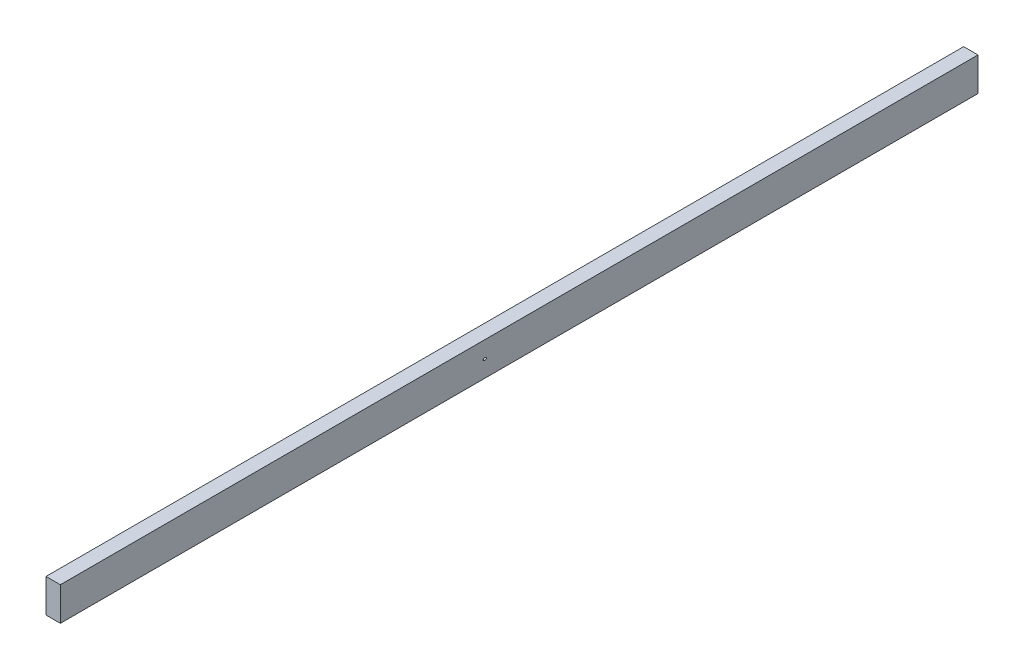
ISO-10303-21;
HEADER;
FILE_DESCRIPTION(('STEP AP214'),'2;1');
FILE_NAME('part.step','',(''),(''),'','','');
FILE_SCHEMA(('AUTOMOTIVE_DESIGN { 1 0 10303 214 1 1 1 1 }'));
ENDSEC;
DATA;
#1=APPLICATION_CONTEXT('core data for automotive mechanical design processes');
#2=APPLICATION_PROTOCOL_DEFINITION('international standard','automotive_design',2000,#1);
#3=PRODUCT_CONTEXT('',#1,'mechanical');
#4=PRODUCT('Part','Part','',(#3));
#5=PRODUCT_RELATED_PRODUCT_CATEGORY('part','',(#4));
#6=PRODUCT_DEFINITION_FORMATION('','',#4);
#7=PRODUCT_DEFINITION_CONTEXT('part definition',#1,'design');
#8=PRODUCT_DEFINITION('design','',#6,#7);
#9=PRODUCT_DEFINITION_SHAPE('','',#8);
#10=(LENGTH_UNIT() NAMED_UNIT(*) SI_UNIT(.MILLI.,.METRE.));
#11=(NAMED_UNIT(*) PLANE_ANGLE_UNIT() SI_UNIT($,.RADIAN.));
#12=(NAMED_UNIT(*) SI_UNIT($,.STERADIAN.) SOLID_ANGLE_UNIT());
#13=UNCERTAINTY_MEASURE_WITH_UNIT(LENGTH_MEASURE(1.E-05),#10,'distance_accuracy_value','');
#14=(GEOMETRIC_REPRESENTATION_CONTEXT(3) GLOBAL_UNCERTAINTY_ASSIGNED_CONTEXT((#13)) GLOBAL_UNIT_ASSIGNED_CONTEXT((#10,
#11,#12)) REPRESENTATION_CONTEXT('',''));
#15=CARTESIAN_POINT('',(0.,0.,0.));
#16=DIRECTION('',(0.,0.,1.));
#17=DIRECTION('',(1.,0.,0.));
#18=AXIS2_PLACEMENT_3D('',#15,#16,#17);
#19=CARTESIAN_POINT('',(19.05,-44.45,-2438.4));
#20=DIRECTION('',(1.,0.,0.));
#21=DIRECTION('',(0.,0.,-1.));
#22=AXIS2_PLACEMENT_3D('',#19,#20,#21);
#23=PLANE('',#22);
#24=CARTESIAN_POINT('',(19.05,0.,-1127.7854));
#25=DIRECTION('',(1.,0.,0.));
#26=DIRECTION('',(0.,0.,-1.));
#27=AXIS2_PLACEMENT_3D('',#24,#25,#26);
#28=ELLIPSE('',#27,4.49012806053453,3.17499999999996);
#29=CARTESIAN_POINT('',(19.05,0.,-1132.27552806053));
#30=VERTEX_POINT('',#29);
#31=EDGE_CURVE('E36',#30,#30,#28,.F.);
#32=ORIENTED_EDGE('',*,*,#31,.T.);
#33=EDGE_LOOP('',(#32));
#34=FACE_BOUND('',#33,.T.);
#35=DIRECTION('',(0.,1.,0.));
#36=VECTOR('',#35,1.);
#37=CARTESIAN_POINT('',(19.05,-44.45,0.));
#38=LINE('',#37,#36);
#39=CARTESIAN_POINT('',(19.05,-44.45,0.));
#40=VERTEX_POINT('',#39);
#41=CARTESIAN_POINT('',(19.05,44.45,0.));
#42=VERTEX_POINT('',#41);
#43=EDGE_CURVE('E100',#40,#42,#38,.T.);
#44=ORIENTED_EDGE('',*,*,#43,.F.);
#45=DIRECTION('',(0.,0.,1.));
#46=VECTOR('',#45,1.);
#47=CARTESIAN_POINT('',(19.05,-44.45,-2438.4));
#48=LINE('',#47,#46);
#49=CARTESIAN_POINT('',(19.05,-44.45,-2438.4));
#50=VERTEX_POINT('',#49);
#51=EDGE_CURVE('E11',#50,#40,#48,.T.);
#52=ORIENTED_EDGE('',*,*,#51,.F.);
#53=DIRECTION('',(0.,1.,0.));
#54=VECTOR('',#53,1.);
#55=CARTESIAN_POINT('',(19.05,-44.45,-2438.4));
#56=LINE('',#55,#54);
#57=CARTESIAN_POINT('',(19.05,44.45,-2438.4));
#58=VERTEX_POINT('',#57);
#59=EDGE_CURVE('E93',#50,#58,#56,.T.);
#60=ORIENTED_EDGE('',*,*,#59,.T.);
#61=DIRECTION('',(0.,0.,1.));
#62=VECTOR('',#61,1.);
#63=CARTESIAN_POINT('',(19.05,44.45,-2438.4));
#64=LINE('',#63,#62);
#65=EDGE_CURVE('E76',#58,#42,#64,.T.);
#66=ORIENTED_EDGE('',*,*,#65,.T.);
#67=EDGE_LOOP('',(#44,#52,#60,#66));
#68=FACE_BOUND('',#67,.T.);
#69=ADVANCED_FACE('F33',(#34,#68),#23,.T.);
#70=CARTESIAN_POINT('',(-19.05,-44.45,-2438.4));
#71=DIRECTION('',(0.,-1.,0.));
#72=DIRECTION('',(0.,0.,-1.));
#73=AXIS2_PLACEMENT_3D('',#70,#71,#72);
#74=PLANE('',#73);
#75=DIRECTION('',(1.,0.,0.));
#76=VECTOR('',#75,1.);
#77=CARTESIAN_POINT('',(-19.05,-44.45,0.));
#78=LINE('',#77,#76);
#79=CARTESIAN_POINT('',(-19.05,-44.45,0.));
#80=VERTEX_POINT('',#79);
#81=EDGE_CURVE('E95',#80,#40,#78,.T.);
#82=ORIENTED_EDGE('',*,*,#81,.F.);
#83=DIRECTION('',(0.,0.,1.));
#84=VECTOR('',#83,1.);
#85=CARTESIAN_POINT('',(-19.05,-44.45,-2438.4));
#86=LINE('',#85,#84);
#87=CARTESIAN_POINT('',(-19.05,-44.45,-2438.4));
#88=VERTEX_POINT('',#87);
#89=EDGE_CURVE('E42',#88,#80,#86,.T.);
#90=ORIENTED_EDGE('',*,*,#89,.F.);
#91=DIRECTION('',(1.,0.,0.));
#92=VECTOR('',#91,1.);
#93=CARTESIAN_POINT('',(-19.05,-44.45,-2438.4));
#94=LINE('',#93,#92);
#95=EDGE_CURVE('E90',#88,#50,#94,.T.);
#96=ORIENTED_EDGE('',*,*,#95,.T.);
#97=ORIENTED_EDGE('',*,*,#51,.T.);
#98=EDGE_LOOP('',(#82,#90,#96,#97));
#99=FACE_BOUND('',#98,.T.);
#100=ADVANCED_FACE('F110',(#99),#74,.T.);
#101=CARTESIAN_POINT('',(-19.05,-44.45,-2438.4));
#102=DIRECTION('',(-1.,0.,0.));
#103=DIRECTION('',(0.,0.,1.));
#104=AXIS2_PLACEMENT_3D('',#101,#102,#103);
#105=PLANE('',#104);
#106=CARTESIAN_POINT('',(-19.05,0.,-1165.8854));
#107=DIRECTION('',(-1.,0.,0.));
#108=DIRECTION('',(0.,0.,1.));
#109=AXIS2_PLACEMENT_3D('',#106,#107,#108);
#110=ELLIPSE('',#109,1.68379802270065,1.19062500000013);
#111=CARTESIAN_POINT('',(-19.05,0.,-1164.2016019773));
#112=VERTEX_POINT('',#111);
#113=EDGE_CURVE('E146',#112,#112,#110,.T.);
#114=ORIENTED_EDGE('',*,*,#113,.F.);
#115=EDGE_LOOP('',(#114));
#116=FACE_BOUND('',#115,.T.);
#117=DIRECTION('',(0.,-1.,0.));
#118=VECTOR('',#117,1.);
#119=CARTESIAN_POINT('',(-19.05,-44.45,0.));
#120=LINE('',#119,#118);
#121=CARTESIAN_POINT('',(-19.05,44.45,0.));
#122=VERTEX_POINT('',#121);
#123=EDGE_CURVE('E84',#122,#80,#120,.T.);
#124=ORIENTED_EDGE('',*,*,#123,.F.);
#125=DIRECTION('',(0.,0.,1.));
#126=VECTOR('',#125,1.);
#127=CARTESIAN_POINT('',(-19.05,44.45,-2438.4));
#128=LINE('',#127,#126);
#129=CARTESIAN_POINT('',(-19.05,44.45,-2438.4));
#130=VERTEX_POINT('',#129);
#131=EDGE_CURVE('E79',#130,#122,#128,.T.);
#132=ORIENTED_EDGE('',*,*,#131,.F.);
#133=DIRECTION('',(0.,-1.,0.));
#134=VECTOR('',#133,1.);
#135=CARTESIAN_POINT('',(-19.05,-44.45,-2438.4));
#136=LINE('',#135,#134);
#137=EDGE_CURVE('E82',#130,#88,#136,.T.);
#138=ORIENTED_EDGE('',*,*,#137,.T.);
#139=ORIENTED_EDGE('',*,*,#89,.T.);
#140=EDGE_LOOP('',(#124,#132,#138,#139));
#141=FACE_BOUND('',#140,.T.);
#142=ADVANCED_FACE('F81',(#116,#141),#105,.T.);
#143=CARTESIAN_POINT('',(-19.05,44.45,-2438.4));
#144=DIRECTION('',(0.,1.,0.));
#145=DIRECTION('',(0.,0.,1.));
#146=AXIS2_PLACEMENT_3D('',#143,#144,#145);
#147=PLANE('',#146);
#148=DIRECTION('',(-1.,0.,0.));
#149=VECTOR('',#148,1.);
#150=CARTESIAN_POINT('',(-19.05,44.45,0.));
#151=LINE('',#150,#149);
#152=EDGE_CURVE('E103',#42,#122,#151,.T.);
#153=ORIENTED_EDGE('',*,*,#152,.F.);
#154=ORIENTED_EDGE('',*,*,#65,.F.);
#155=DIRECTION('',(-1.,0.,0.));
#156=VECTOR('',#155,1.);
#157=CARTESIAN_POINT('',(-19.05,44.45,-2438.4));
#158=LINE('',#157,#156);
#159=EDGE_CURVE('E89',#58,#130,#158,.T.);
#160=ORIENTED_EDGE('',*,*,#159,.T.);
#161=ORIENTED_EDGE('',*,*,#131,.T.);
#162=EDGE_LOOP('',(#153,#154,#160,#161));
#163=FACE_BOUND('',#162,.T.);
#164=ADVANCED_FACE('F92',(#163),#147,.T.);
#165=CARTESIAN_POINT('',(0.,0.,-2438.4));
#166=DIRECTION('',(0.,0.,-1.));
#167=DIRECTION('',(-1.,0.,0.));
#168=AXIS2_PLACEMENT_3D('',#165,#166,#167);
#169=PLANE('',#168);
#170=ORIENTED_EDGE('',*,*,#59,.F.);
#171=ORIENTED_EDGE('',*,*,#95,.F.);
#172=ORIENTED_EDGE('',*,*,#137,.F.);
#173=ORIENTED_EDGE('',*,*,#159,.F.);
#174=EDGE_LOOP('',(#170,#171,#172,#173));
#175=FACE_BOUND('',#174,.T.);
#176=ADVANCED_FACE('F88',(#175),#169,.T.);
#177=CARTESIAN_POINT('',(0.,0.,0.));
#178=DIRECTION('',(0.,0.,-1.));
#179=DIRECTION('',(-1.,0.,0.));
#180=AXIS2_PLACEMENT_3D('',#177,#178,#179);
#181=PLANE('',#180);
#182=ORIENTED_EDGE('',*,*,#43,.T.);
#183=ORIENTED_EDGE('',*,*,#152,.T.);
#184=ORIENTED_EDGE('',*,*,#123,.T.);
#185=ORIENTED_EDGE('',*,*,#81,.T.);
#186=EDGE_LOOP('',(#182,#183,#184,#185));
#187=FACE_BOUND('',#186,.T.);
#188=ADVANCED_FACE('F109',(#187),#181,.F.);
#189=CARTESIAN_POINT('',(54.9710244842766,0.,-1091.86437551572));
#190=DIRECTION('',(-0.707106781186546,0.,-0.707106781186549));
#191=DIRECTION('',(-0.707106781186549,0.,0.707106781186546));
#192=AXIS2_PLACEMENT_3D('',#189,#190,#191);
#193=CYLINDRICAL_SURFACE('',#192,3.17499999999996);
#194=ORIENTED_EDGE('',*,*,#31,.F.);
#195=EDGE_LOOP('',(#194));
#196=FACE_BOUND('',#195,.T.);
#197=CARTESIAN_POINT('',(-1.15557627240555,0.,-1147.99097627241));
#198=DIRECTION('',(0.707106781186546,0.,0.707106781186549));
#199=DIRECTION('',(0.707106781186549,0.,-0.707106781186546));
#200=AXIS2_PLACEMENT_3D('',#197,#198,#199);
#201=CIRCLE('',#200,3.17499999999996);
#202=CARTESIAN_POINT('',(1.08948775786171,0.,-1150.23604030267));
#203=VERTEX_POINT('',#202);
#204=EDGE_CURVE('E151',#203,#203,#201,.T.);
#205=ORIENTED_EDGE('',*,*,#204,.F.);
#206=EDGE_LOOP('',(#205));
#207=FACE_BOUND('',#206,.T.);
#208=ADVANCED_FACE('F129',(#196,#207),#193,.F.);
#209=CARTESIAN_POINT('',(-574.573276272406,0.,-574.573276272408));
#210=DIRECTION('',(0.707106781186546,0.,0.707106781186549));
#211=DIRECTION('',(0.707106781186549,0.,-0.707106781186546));
#212=AXIS2_PLACEMENT_3D('',#209,#210,#211);
#213=PLANE('',#212);
#214=CARTESIAN_POINT('',(-1.15557627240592,0.,-1147.99097627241));
#215=DIRECTION('',(0.707106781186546,0.,0.707106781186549));
#216=DIRECTION('',(0.707106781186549,0.,-0.707106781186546));
#217=AXIS2_PLACEMENT_3D('',#214,#215,#216);
#218=CIRCLE('',#217,1.19062500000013);
#219=CARTESIAN_POINT('',(-0.313677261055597,0.,-1148.83287528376));
#220=VERTEX_POINT('',#219);
#221=EDGE_CURVE('E149',#220,#220,#218,.T.);
#222=ORIENTED_EDGE('',*,*,#221,.F.);
#223=EDGE_LOOP('',(#222));
#224=FACE_BOUND('',#223,.T.);
#225=ORIENTED_EDGE('',*,*,#204,.T.);
#226=EDGE_LOOP('',(#225));
#227=FACE_BOUND('',#226,.T.);
#228=ADVANCED_FACE('F133',(#224,#227),#213,.T.);
#229=CARTESIAN_POINT('',(-655.3073,0.,-1802.1427));
#230=DIRECTION('',(0.707106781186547,0.,0.707106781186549));
#231=DIRECTION('',(0.707106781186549,0.,-0.707106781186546));
#232=AXIS2_PLACEMENT_3D('',#229,#230,#231);
#233=CYLINDRICAL_SURFACE('',#232,1.19062500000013);
#234=ORIENTED_EDGE('',*,*,#113,.T.);
#235=EDGE_LOOP('',(#234));
#236=FACE_BOUND('',#235,.T.);
#237=ORIENTED_EDGE('',*,*,#221,.T.);
#238=EDGE_LOOP('',(#237));
#239=FACE_BOUND('',#238,.T.);
#240=ADVANCED_FACE('F137',(#236,#239),#233,.F.);
#241=CLOSED_SHELL('',(#69,#100,#142,#164,#176,#188,#208,#228,#240));
#242=MANIFOLD_SOLID_BREP('B2',#241);
#243=ADVANCED_BREP_SHAPE_REPRESENTATION('',(#18,#242),#14);
#244=SHAPE_DEFINITION_REPRESENTATION(#9,#243);
ENDSEC;
END-ISO-10303-21;
